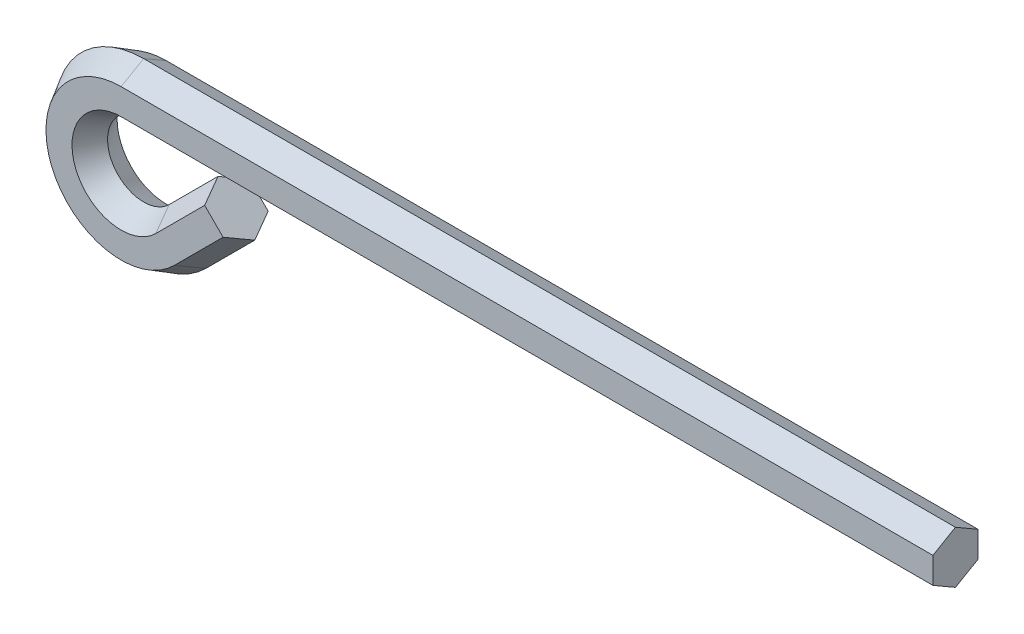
from build123d import *


with BuildPart() as part:
    # Base-Sweep: sweep along a path in Sketch1
    with BuildLine(Plane.XY) as base_sweep_path:
        Line((90, 4), (0, 4))
        ThreePointArc((0, 4), (-3.69551813, -1.530733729), (2.828427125, -2.828427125))
        Line((2.828427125, -2.828427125), (8.242640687, 2.585786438))
    # Sketch2 → Base-Sweep (sweep)
    with BuildSketch(Plane(origin=(90, 4, 0), x_dir=(0, 0, 1), z_dir=(-1, 0, 0))):
        Polygon((-2.5, 4.330127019), (0, 5.773502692), (2.5, 4.330127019), (2.5, 1.443375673), (0, 0), (-2.5, 1.443375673), align=None)
    sweep(path=base_sweep_path.line)


solid = part.part
